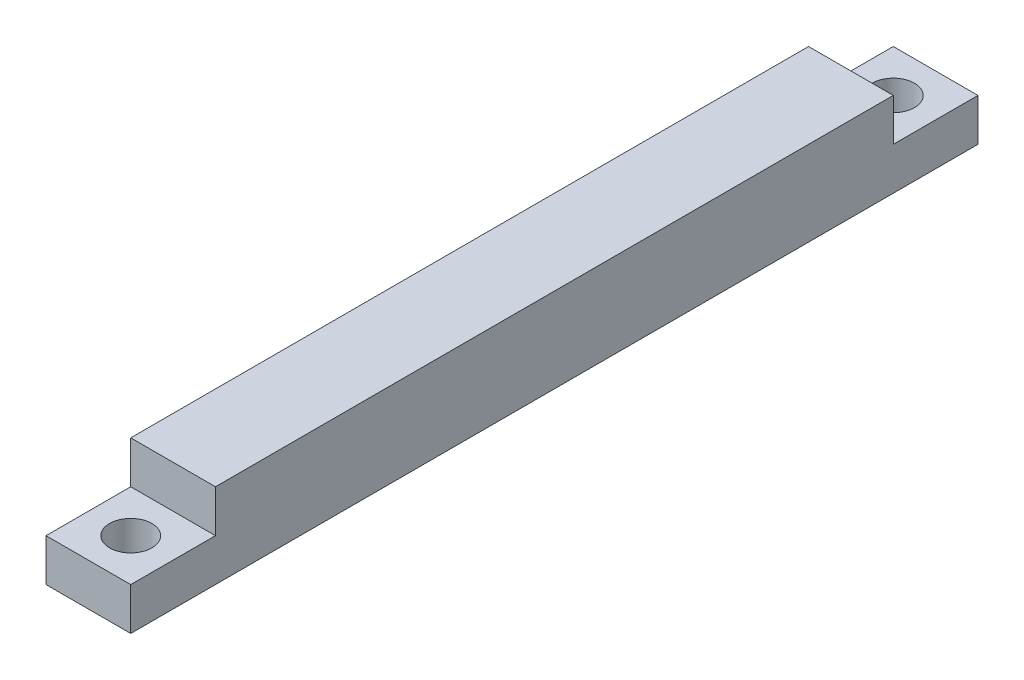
from build123d import *

# Parameters (mm, degrees)
ESQUISSE1_W             = 10
ESQUISSE1_H             = 10
BOSS_EXTRU_1_DEPTH      = 80
ESQUISSE4_W             = 10
ESQUISSE4_H             = 5
BOSS_EXTRU_2_DEPTH      = 10
ESQUISSE5_R             = 2.5
ENL_V_MAT_EXTRU_2_DEPTH = 91.691785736


with BuildPart() as part:
    # Esquisse1 → Boss.-Extru.1 (new body)
    with BuildSketch(Plane.XY):
        with Locations((-5, 5)):
            Rectangle(ESQUISSE1_W, ESQUISSE1_H)
    extrude(amount=BOSS_EXTRU_1_DEPTH)

    # Esquisse4 → Boss.-Extru.2 (add)
    with BuildSketch(Plane(origin=(0, 0, 0), x_dir=(0, 0, -1), z_dir=(1, 0, 0))):
        with Locations((-85, 2.5)):
            Rectangle(ESQUISSE4_W, ESQUISSE4_H)
        with Locations((5, 2.5)):
            Rectangle(ESQUISSE4_W, ESQUISSE4_H)
    extrude(amount=-BOSS_EXTRU_2_DEPTH)

    # Esquisse5 → Enl_v. mat.-Extru.2 (cut, through all)
    with BuildSketch(Plane(origin=(0, 5, 0), x_dir=(1, 0, 0), z_dir=(0, 1, 0))):
        with Locations(Location((-5, -85, 0), (0, 0, 270))):
            Circle(ESQUISSE5_R)
        with Locations(Location((-5, 5, 0), (0, 0, 270))):
            Circle(ESQUISSE5_R)
    extrude(amount=-ENL_V_MAT_EXTRU_2_DEPTH, mode=Mode.SUBTRACT)


solid = part.part
